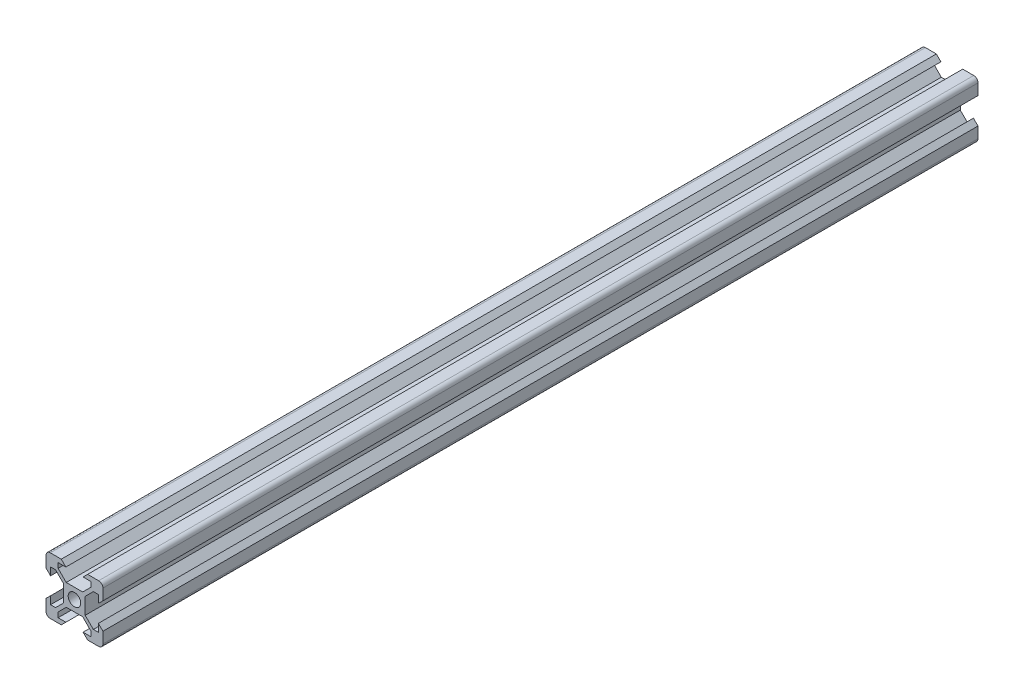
from build123d import *

# Parameters (mm, degrees)
SKETCH1_W           = 15.088
SKETCH1_H           = 15.088
SKETCH1_R           = 4.4
BOSS_EXTRUDE1_DEPTH = 307.5


with BuildPart() as part:
    # Sketch1 → Boss-Extrude1 (new, symmetric)
    # profile 1 of 5: a face of its own
    with BuildSketch(Plane.XY):
        with BuildLine():
            Line((-7.544, 7.544), (-5.784718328, 7.544))
            Line((-5.784718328, 7.544), (-11.512, 13.271281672))
            Line((-11.512, 13.271281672), (-11.512, 16.8))
            Line((-11.512, 16.8), (-6.051976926, 16.8))
            Line((-6.051976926, 16.8), (-9.251976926, 20))
            Line((-9.251976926, 20), (-17, 20))
            ThreePointArc((-17, 20), (-19.121320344, 19.121320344), (-20, 17))
            Line((-20, 17), (-20, 9.251976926))
            Line((-20, 9.251976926), (-16.8, 6.051976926))
            Line((-16.8, 6.051976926), (-16.8, 11.512))
            Line((-16.8, 11.512), (-13.271281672, 11.512))
            Line((-13.271281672, 11.512), (-7.544, 5.784718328))
            Line((-7.544, 5.784718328), (-7.544, 7.544))
        make_face()
    # profile 2 of 5: a face of its own
    with BuildSketch(Plane.XY):
        with BuildLine():
            Line((11.512, 13.271281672), (5.784718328, 7.544))
            Line((5.784718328, 7.544), (7.544, 7.544))
            Line((7.544, 7.544), (7.544, 5.784718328))
            Line((7.544, 5.784718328), (13.271281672, 11.512))
            Line((13.271281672, 11.512), (16.8, 11.512))
            Line((16.8, 11.512), (16.8, 6.051976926))
            Line((16.8, 6.051976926), (20, 9.251976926))
            Line((20, 9.251976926), (20, 17))
            ThreePointArc((20, 17), (19.121320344, 19.121320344), (17, 20))
            Line((17, 20), (9.251976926, 20))
            Line((9.251976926, 20), (6.051976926, 16.8))
            Line((6.051976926, 16.8), (11.512, 16.8))
            Line((11.512, 16.8), (11.512, 13.271281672))
        make_face()
    # profile 3 of 5: a face of its own
    with BuildSketch(Plane.XY):
        with BuildLine():
            Line((-7.544, -7.544), (-7.544, -5.784718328))
            Line((-7.544, -5.784718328), (-13.271281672, -11.512))
            Line((-13.271281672, -11.512), (-16.8, -11.512))
            Line((-16.8, -11.512), (-16.8, -6.051976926))
            Line((-16.8, -6.051976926), (-20, -9.251976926))
            Line((-20, -9.251976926), (-20, -17))
            ThreePointArc((-20, -17), (-19.121320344, -19.121320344), (-17, -20))
            Line((-17, -20), (-9.251976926, -20))
            Line((-9.251976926, -20), (-6.051976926, -16.8))
            Line((-6.051976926, -16.8), (-11.512, -16.8))
            Line((-11.512, -16.8), (-11.512, -13.271281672))
            Line((-11.512, -13.271281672), (-5.784718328, -7.544))
            Line((-5.784718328, -7.544), (-7.544, -7.544))
        make_face()
    # profile 4 of 5: a face of its own
    with BuildSketch(Plane.XY):
        with BuildLine():
            Line((13.271281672, -11.512), (7.544, -5.784718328))
            Line((7.544, -5.784718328), (7.544, -7.544))
            Line((7.544, -7.544), (5.784718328, -7.544))
            Line((5.784718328, -7.544), (11.512, -13.271281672))
            Line((11.512, -13.271281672), (11.512, -16.8))
            Line((11.512, -16.8), (6.051976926, -16.8))
            Line((6.051976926, -16.8), (9.251976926, -20))
            Line((9.251976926, -20), (17, -20))
            ThreePointArc((17, -20), (19.121320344, -19.121320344), (20, -17))
            Line((20, -17), (20, -9.251976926))
            Line((20, -9.251976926), (16.8, -6.051976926))
            Line((16.8, -6.051976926), (16.8, -11.512))
            Line((16.8, -11.512), (13.271281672, -11.512))
        make_face()
    # profile 5 of 5: a face of its own
    with BuildSketch(Plane.XY):
        Rectangle(SKETCH1_W, SKETCH1_H)
        Circle(SKETCH1_R, mode=Mode.SUBTRACT)
    extrude(amount=BOSS_EXTRUDE1_DEPTH, both=True)


solid = part.part
